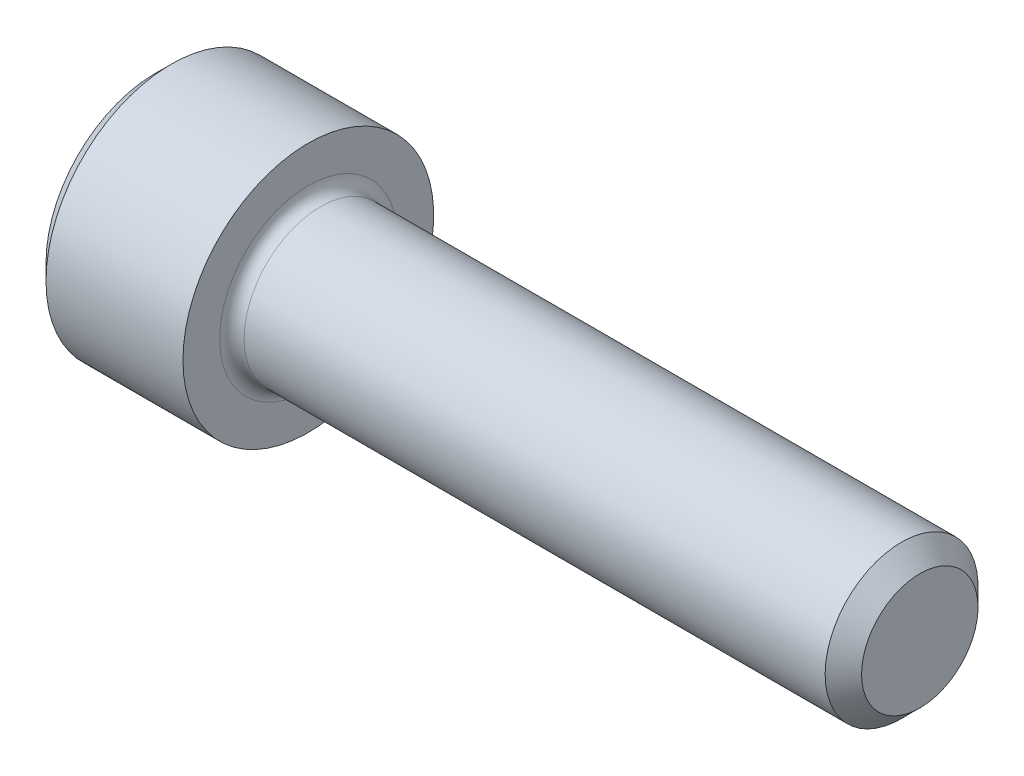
ISO-10303-21;
HEADER;
FILE_DESCRIPTION(('STEP AP214'),'2;1');
FILE_NAME('part.step','',(''),(''),'','','');
FILE_SCHEMA(('AUTOMOTIVE_DESIGN { 1 0 10303 214 1 1 1 1 }'));
ENDSEC;
DATA;
#1=APPLICATION_CONTEXT('core data for automotive mechanical design processes');
#2=APPLICATION_PROTOCOL_DEFINITION('international standard','automotive_design',2000,#1);
#3=PRODUCT_CONTEXT('',#1,'mechanical');
#4=PRODUCT('Part','Part','',(#3));
#5=PRODUCT_RELATED_PRODUCT_CATEGORY('part','',(#4));
#6=PRODUCT_DEFINITION_FORMATION('','',#4);
#7=PRODUCT_DEFINITION_CONTEXT('part definition',#1,'design');
#8=PRODUCT_DEFINITION('design','',#6,#7);
#9=PRODUCT_DEFINITION_SHAPE('','',#8);
#10=(LENGTH_UNIT() NAMED_UNIT(*) SI_UNIT(.MILLI.,.METRE.));
#11=(NAMED_UNIT(*) PLANE_ANGLE_UNIT() SI_UNIT($,.RADIAN.));
#12=(NAMED_UNIT(*) SI_UNIT($,.STERADIAN.) SOLID_ANGLE_UNIT());
#13=UNCERTAINTY_MEASURE_WITH_UNIT(LENGTH_MEASURE(1.E-05),#10,'distance_accuracy_value','');
#14=(GEOMETRIC_REPRESENTATION_CONTEXT(3) GLOBAL_UNCERTAINTY_ASSIGNED_CONTEXT((#13)) GLOBAL_UNIT_ASSIGNED_CONTEXT((#10,
#11,#12)) REPRESENTATION_CONTEXT('',''));
#15=CARTESIAN_POINT('',(0.,0.,0.));
#16=DIRECTION('',(0.,0.,1.));
#17=DIRECTION('',(1.,0.,0.));
#18=AXIS2_PLACEMENT_3D('',#15,#16,#17);
#19=CARTESIAN_POINT('',(0.,0.,0.));
#20=DIRECTION('',(-1.,0.,0.));
#21=DIRECTION('',(0.,0.,1.));
#22=AXIS2_PLACEMENT_3D('',#19,#20,#21);
#23=PLANE('',#22);
#24=DIRECTION('',(0.,-0.499999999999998,0.866025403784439));
#25=VECTOR('',#24,1.);
#26=CARTESIAN_POINT('',(0.,1.37848150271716,0.));
#27=LINE('',#26,#25);
#28=CARTESIAN_POINT('',(0.,1.37848150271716,0.));
#29=VERTEX_POINT('',#28);
#30=CARTESIAN_POINT('',(0.,0.689240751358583,1.1938));
#31=VERTEX_POINT('',#30);
#32=EDGE_CURVE('E265',#29,#31,#27,.T.);
#33=ORIENTED_EDGE('',*,*,#32,.T.);
#34=DIRECTION('',(0.,1.,0.));
#35=VECTOR('',#34,1.);
#36=CARTESIAN_POINT('',(0.,-0.689240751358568,1.1938));
#37=LINE('',#36,#35);
#38=CARTESIAN_POINT('',(0.,-0.689240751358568,1.1938));
#39=VERTEX_POINT('',#38);
#40=EDGE_CURVE('E125',#39,#31,#37,.T.);
#41=ORIENTED_EDGE('',*,*,#40,.F.);
#42=DIRECTION('',(0.,-0.500000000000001,-0.866025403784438));
#43=VECTOR('',#42,1.);
#44=CARTESIAN_POINT('',(0.,-0.689240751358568,1.1938));
#45=LINE('',#44,#43);
#46=CARTESIAN_POINT('',(0.,-1.37848150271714,0.));
#47=VERTEX_POINT('',#46);
#48=EDGE_CURVE('E268',#39,#47,#45,.T.);
#49=ORIENTED_EDGE('',*,*,#48,.T.);
#50=DIRECTION('',(0.,0.499999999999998,-0.86602540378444));
#51=VECTOR('',#50,1.);
#52=CARTESIAN_POINT('',(0.,-1.37848150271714,0.));
#53=LINE('',#52,#51);
#54=CARTESIAN_POINT('',(0.,-0.689240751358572,-1.1938));
#55=VERTEX_POINT('',#54);
#56=EDGE_CURVE('E271',#47,#55,#53,.T.);
#57=ORIENTED_EDGE('',*,*,#56,.T.);
#58=DIRECTION('',(0.,-1.,0.));
#59=VECTOR('',#58,1.);
#60=CARTESIAN_POINT('',(0.,0.689240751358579,-1.1938));
#61=LINE('',#60,#59);
#62=CARTESIAN_POINT('',(0.,0.689240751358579,-1.1938));
#63=VERTEX_POINT('',#62);
#64=EDGE_CURVE('E274',#63,#55,#61,.T.);
#65=ORIENTED_EDGE('',*,*,#64,.F.);
#66=DIRECTION('',(0.,-0.500000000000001,-0.866025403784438));
#67=VECTOR('',#66,1.);
#68=CARTESIAN_POINT('',(0.,1.37848150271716,0.));
#69=LINE('',#68,#67);
#70=EDGE_CURVE('E120',#29,#63,#69,.T.);
#71=ORIENTED_EDGE('',*,*,#70,.F.);
#72=EDGE_LOOP('',(#33,#41,#49,#57,#65,#71));
#73=FACE_BOUND('',#72,.T.);
#74=CARTESIAN_POINT('',(0.,0.,0.));
#75=DIRECTION('',(-1.,0.,0.));
#76=DIRECTION('',(0.,0.,1.));
#77=AXIS2_PLACEMENT_3D('',#74,#75,#76);
#78=CIRCLE('',#77,2.2733);
#79=CARTESIAN_POINT('',(0.,0.,2.2733));
#80=VERTEX_POINT('',#79);
#81=EDGE_CURVE('E149',#80,#80,#78,.T.);
#82=ORIENTED_EDGE('',*,*,#81,.T.);
#83=EDGE_LOOP('',(#82));
#84=FACE_BOUND('',#83,.T.);
#85=ADVANCED_FACE('F33',(#73,#84),#23,.T.);
#86=CARTESIAN_POINT('',(0.,0.,0.));
#87=DIRECTION('',(1.,0.,0.));
#88=DIRECTION('',(0.,0.,-1.));
#89=AXIS2_PLACEMENT_3D('',#86,#87,#88);
#90=CONICAL_SURFACE('',#89,2.2733,0.785398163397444);
#91=CARTESIAN_POINT('',(0.330200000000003,0.,0.));
#92=DIRECTION('',(-1.,0.,0.));
#93=DIRECTION('',(0.,0.,1.));
#94=AXIS2_PLACEMENT_3D('',#91,#92,#93);
#95=CIRCLE('',#94,2.6035);
#96=CARTESIAN_POINT('',(0.330200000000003,0.,2.6035));
#97=VERTEX_POINT('',#96);
#98=EDGE_CURVE('E146',#97,#97,#95,.T.);
#99=ORIENTED_EDGE('',*,*,#98,.T.);
#100=EDGE_LOOP('',(#99));
#101=FACE_BOUND('',#100,.T.);
#102=ORIENTED_EDGE('',*,*,#81,.F.);
#103=EDGE_LOOP('',(#102));
#104=FACE_BOUND('',#103,.T.);
#105=ADVANCED_FACE('F170',(#101,#104),#90,.T.);
#106=CARTESIAN_POINT('',(-31.75,0.,0.));
#107=DIRECTION('',(-1.,0.,0.));
#108=DIRECTION('',(0.,0.,1.));
#109=AXIS2_PLACEMENT_3D('',#106,#107,#108);
#110=CYLINDRICAL_SURFACE('',#109,2.6035);
#111=CARTESIAN_POINT('',(3.175,0.,0.));
#112=DIRECTION('',(-1.,0.,0.));
#113=DIRECTION('',(0.,0.,1.));
#114=AXIS2_PLACEMENT_3D('',#111,#112,#113);
#115=CIRCLE('',#114,2.6035);
#116=CARTESIAN_POINT('',(3.175,0.,2.6035));
#117=VERTEX_POINT('',#116);
#118=EDGE_CURVE('E143',#117,#117,#115,.T.);
#119=ORIENTED_EDGE('',*,*,#118,.T.);
#120=EDGE_LOOP('',(#119));
#121=FACE_BOUND('',#120,.T.);
#122=ORIENTED_EDGE('',*,*,#98,.F.);
#123=EDGE_LOOP('',(#122));
#124=FACE_BOUND('',#123,.T.);
#125=ADVANCED_FACE('F175',(#121,#124),#110,.T.);
#126=CARTESIAN_POINT('',(3.175,2.6035,0.));
#127=DIRECTION('',(1.,0.,0.));
#128=DIRECTION('',(0.,0.,-1.));
#129=AXIS2_PLACEMENT_3D('',#126,#127,#128);
#130=PLANE('',#129);
#131=CARTESIAN_POINT('',(3.175,0.,0.));
#132=DIRECTION('',(1.,0.,0.));
#133=DIRECTION('',(0.,0.,-1.));
#134=AXIS2_PLACEMENT_3D('',#131,#132,#133);
#135=CIRCLE('',#134,1.8415);
#136=CARTESIAN_POINT('',(3.175,0.,-1.8415));
#137=VERTEX_POINT('',#136);
#138=EDGE_CURVE('E41',#137,#137,#135,.F.);
#139=ORIENTED_EDGE('',*,*,#138,.T.);
#140=EDGE_LOOP('',(#139));
#141=FACE_BOUND('',#140,.T.);
#142=ORIENTED_EDGE('',*,*,#118,.F.);
#143=EDGE_LOOP('',(#142));
#144=FACE_BOUND('',#143,.T.);
#145=ADVANCED_FACE('F154',(#141,#144),#130,.T.);
#146=CARTESIAN_POINT('',(-31.75,0.,0.));
#147=DIRECTION('',(-1.,0.,0.));
#148=DIRECTION('',(0.,0.,1.));
#149=AXIS2_PLACEMENT_3D('',#146,#147,#148);
#150=CYLINDRICAL_SURFACE('',#149,1.5875);
#151=CARTESIAN_POINT('',(3.429,0.,0.));
#152=DIRECTION('',(1.,0.,0.));
#153=DIRECTION('',(0.,0.,-1.));
#154=AXIS2_PLACEMENT_3D('',#151,#152,#153);
#155=CIRCLE('',#154,1.5875);
#156=CARTESIAN_POINT('',(3.429,0.,-1.5875));
#157=VERTEX_POINT('',#156);
#158=EDGE_CURVE('E11',#157,#157,#155,.T.);
#159=ORIENTED_EDGE('',*,*,#158,.T.);
#160=EDGE_LOOP('',(#159));
#161=FACE_BOUND('',#160,.T.);
#162=CARTESIAN_POINT('',(15.49654,0.,0.));
#163=DIRECTION('',(-1.,0.,0.));
#164=DIRECTION('',(0.,0.,1.));
#165=AXIS2_PLACEMENT_3D('',#162,#163,#164);
#166=CIRCLE('',#165,1.5875);
#167=CARTESIAN_POINT('',(15.49654,0.,1.5875));
#168=VERTEX_POINT('',#167);
#169=EDGE_CURVE('E140',#168,#168,#166,.T.);
#170=ORIENTED_EDGE('',*,*,#169,.T.);
#171=EDGE_LOOP('',(#170));
#172=FACE_BOUND('',#171,.T.);
#173=ADVANCED_FACE('F185',(#161,#172),#150,.T.);
#174=CARTESIAN_POINT('',(15.875,0.,0.));
#175=DIRECTION('',(-1.,0.,0.));
#176=DIRECTION('',(0.,0.,1.));
#177=AXIS2_PLACEMENT_3D('',#174,#175,#176);
#178=CONICAL_SURFACE('',#177,1.20904,0.785398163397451);
#179=ORIENTED_EDGE('',*,*,#169,.F.);
#180=EDGE_LOOP('',(#179));
#181=FACE_BOUND('',#180,.T.);
#182=CARTESIAN_POINT('',(15.875,0.,0.));
#183=DIRECTION('',(-1.,0.,0.));
#184=DIRECTION('',(0.,0.,1.));
#185=AXIS2_PLACEMENT_3D('',#182,#183,#184);
#186=CIRCLE('',#185,1.20904);
#187=CARTESIAN_POINT('',(15.875,0.,1.20904));
#188=VERTEX_POINT('',#187);
#189=EDGE_CURVE('E136',#188,#188,#186,.T.);
#190=ORIENTED_EDGE('',*,*,#189,.T.);
#191=EDGE_LOOP('',(#190));
#192=FACE_BOUND('',#191,.T.);
#193=ADVANCED_FACE('F165',(#181,#192),#178,.T.);
#194=CARTESIAN_POINT('',(15.875,1.20904,0.));
#195=DIRECTION('',(1.,0.,0.));
#196=DIRECTION('',(0.,0.,-1.));
#197=AXIS2_PLACEMENT_3D('',#194,#195,#196);
#198=PLANE('',#197);
#199=ORIENTED_EDGE('',*,*,#189,.F.);
#200=EDGE_LOOP('',(#199));
#201=FACE_BOUND('',#200,.T.);
#202=ADVANCED_FACE('F158',(#201),#198,.T.);
#203=CARTESIAN_POINT('',(3.429,0.,0.));
#204=DIRECTION('',(1.,0.,0.));
#205=DIRECTION('',(0.,0.,-1.));
#206=AXIS2_PLACEMENT_3D('',#203,#204,#205);
#207=TOROIDAL_SURFACE('',#206,1.8415,0.254);
#208=ORIENTED_EDGE('',*,*,#158,.F.);
#209=EDGE_LOOP('',(#208));
#210=FACE_BOUND('',#209,.T.);
#211=ORIENTED_EDGE('',*,*,#138,.F.);
#212=EDGE_LOOP('',(#211));
#213=FACE_BOUND('',#212,.T.);
#214=ADVANCED_FACE('F35',(#210,#213),#207,.F.);
#215=CARTESIAN_POINT('',(1.4478,1.37848150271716,0.));
#216=DIRECTION('',(0.,-0.866025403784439,-0.499999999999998));
#217=DIRECTION('',(0.,0.499999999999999,-0.86602540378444));
#218=AXIS2_PLACEMENT_3D('',#215,#216,#217);
#219=PLANE('',#218);
#220=ORIENTED_EDGE('',*,*,#32,.F.);
#221=DIRECTION('',(-1.,0.,0.));
#222=VECTOR('',#221,1.);
#223=CARTESIAN_POINT('',(1.4478,1.37848150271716,0.));
#224=LINE('',#223,#222);
#225=CARTESIAN_POINT('',(1.4478,1.37848150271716,0.));
#226=VERTEX_POINT('',#225);
#227=EDGE_CURVE('E264',#226,#29,#224,.T.);
#228=ORIENTED_EDGE('',*,*,#227,.F.);
#229=DIRECTION('',(0.,-0.499999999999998,0.866025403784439));
#230=VECTOR('',#229,1.);
#231=CARTESIAN_POINT('',(1.4478,1.37848150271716,0.));
#232=LINE('',#231,#230);
#233=CARTESIAN_POINT('',(1.4478,1.03386112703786,0.596899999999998));
#234=VERTEX_POINT('',#233);
#235=EDGE_CURVE('E48',#226,#234,#232,.T.);
#236=ORIENTED_EDGE('',*,*,#235,.T.);
#237=CARTESIAN_POINT('',(1.4478,0.689240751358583,1.1938));
#238=VERTEX_POINT('',#237);
#239=EDGE_CURVE('E106',#234,#238,#232,.T.);
#240=ORIENTED_EDGE('',*,*,#239,.T.);
#241=DIRECTION('',(-1.,0.,0.));
#242=VECTOR('',#241,1.);
#243=CARTESIAN_POINT('',(1.4478,0.689240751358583,1.1938));
#244=LINE('',#243,#242);
#245=EDGE_CURVE('E118',#238,#31,#244,.T.);
#246=ORIENTED_EDGE('',*,*,#245,.T.);
#247=EDGE_LOOP('',(#220,#228,#236,#240,#246));
#248=FACE_BOUND('',#247,.T.);
#249=ADVANCED_FACE('F117',(#248),#219,.T.);
#250=CARTESIAN_POINT('',(1.4478,-0.689240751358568,1.1938));
#251=DIRECTION('',(0.,0.,1.));
#252=DIRECTION('',(0.,-1.,0.));
#253=AXIS2_PLACEMENT_3D('',#250,#251,#252);
#254=PLANE('',#253);
#255=ORIENTED_EDGE('',*,*,#40,.T.);
#256=ORIENTED_EDGE('',*,*,#245,.F.);
#257=DIRECTION('',(0.,1.,0.));
#258=VECTOR('',#257,1.);
#259=CARTESIAN_POINT('',(1.4478,-0.689240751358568,1.1938));
#260=LINE('',#259,#258);
#261=CARTESIAN_POINT('',(1.4478,0.,1.1938));
#262=VERTEX_POINT('',#261);
#263=EDGE_CURVE('E104',#262,#238,#260,.T.);
#264=ORIENTED_EDGE('',*,*,#263,.F.);
#265=CARTESIAN_POINT('',(1.4478,-0.689240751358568,1.1938));
#266=VERTEX_POINT('',#265);
#267=EDGE_CURVE('E114',#266,#262,#260,.T.);
#268=ORIENTED_EDGE('',*,*,#267,.F.);
#269=DIRECTION('',(-1.,0.,0.));
#270=VECTOR('',#269,1.);
#271=CARTESIAN_POINT('',(1.4478,-0.689240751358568,1.1938));
#272=LINE('',#271,#270);
#273=EDGE_CURVE('E127',#266,#39,#272,.T.);
#274=ORIENTED_EDGE('',*,*,#273,.T.);
#275=EDGE_LOOP('',(#255,#256,#264,#268,#274));
#276=FACE_BOUND('',#275,.T.);
#277=ADVANCED_FACE('F122',(#276),#254,.F.);
#278=CARTESIAN_POINT('',(1.4478,-0.689240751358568,1.1938));
#279=DIRECTION('',(0.,0.866025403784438,-0.500000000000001));
#280=DIRECTION('',(0.,0.500000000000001,0.866025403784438));
#281=AXIS2_PLACEMENT_3D('',#278,#279,#280);
#282=PLANE('',#281);
#283=ORIENTED_EDGE('',*,*,#48,.F.);
#284=ORIENTED_EDGE('',*,*,#273,.F.);
#285=DIRECTION('',(0.,-0.500000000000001,-0.866025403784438));
#286=VECTOR('',#285,1.);
#287=CARTESIAN_POINT('',(1.4478,-0.689240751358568,1.1938));
#288=LINE('',#287,#286);
#289=CARTESIAN_POINT('',(1.4478,-1.03386112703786,0.596899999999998));
#290=VERTEX_POINT('',#289);
#291=EDGE_CURVE('E245',#266,#290,#288,.T.);
#292=ORIENTED_EDGE('',*,*,#291,.T.);
#293=CARTESIAN_POINT('',(1.4478,-1.37848150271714,0.));
#294=VERTEX_POINT('',#293);
#295=EDGE_CURVE('E247',#290,#294,#288,.T.);
#296=ORIENTED_EDGE('',*,*,#295,.T.);
#297=DIRECTION('',(-1.,0.,0.));
#298=VECTOR('',#297,1.);
#299=CARTESIAN_POINT('',(1.4478,-1.37848150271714,0.));
#300=LINE('',#299,#298);
#301=EDGE_CURVE('E132',#294,#47,#300,.T.);
#302=ORIENTED_EDGE('',*,*,#301,.T.);
#303=EDGE_LOOP('',(#283,#284,#292,#296,#302));
#304=FACE_BOUND('',#303,.T.);
#305=ADVANCED_FACE('F197',(#304),#282,.T.);
#306=CARTESIAN_POINT('',(1.4478,-1.37848150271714,0.));
#307=DIRECTION('',(0.,0.866025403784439,0.499999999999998));
#308=DIRECTION('',(0.,-0.499999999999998,0.86602540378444));
#309=AXIS2_PLACEMENT_3D('',#306,#307,#308);
#310=PLANE('',#309);
#311=ORIENTED_EDGE('',*,*,#56,.F.);
#312=ORIENTED_EDGE('',*,*,#301,.F.);
#313=DIRECTION('',(0.,0.499999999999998,-0.86602540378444));
#314=VECTOR('',#313,1.);
#315=CARTESIAN_POINT('',(1.4478,-1.37848150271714,0.));
#316=LINE('',#315,#314);
#317=CARTESIAN_POINT('',(1.4478,-1.03386112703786,-0.596899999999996));
#318=VERTEX_POINT('',#317);
#319=EDGE_CURVE('E250',#294,#318,#316,.T.);
#320=ORIENTED_EDGE('',*,*,#319,.T.);
#321=CARTESIAN_POINT('',(1.4478,-0.689240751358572,-1.1938));
#322=VERTEX_POINT('',#321);
#323=EDGE_CURVE('E254',#318,#322,#316,.T.);
#324=ORIENTED_EDGE('',*,*,#323,.T.);
#325=DIRECTION('',(-1.,0.,0.));
#326=VECTOR('',#325,1.);
#327=CARTESIAN_POINT('',(1.4478,-0.689240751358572,-1.1938));
#328=LINE('',#327,#326);
#329=EDGE_CURVE('E283',#322,#55,#328,.T.);
#330=ORIENTED_EDGE('',*,*,#329,.T.);
#331=EDGE_LOOP('',(#311,#312,#320,#324,#330));
#332=FACE_BOUND('',#331,.T.);
#333=ADVANCED_FACE('F200',(#332),#310,.T.);
#334=CARTESIAN_POINT('',(1.4478,0.689240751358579,-1.1938));
#335=DIRECTION('',(0.,0.,-1.));
#336=DIRECTION('',(0.,1.,0.));
#337=AXIS2_PLACEMENT_3D('',#334,#335,#336);
#338=PLANE('',#337);
#339=ORIENTED_EDGE('',*,*,#64,.T.);
#340=ORIENTED_EDGE('',*,*,#329,.F.);
#341=DIRECTION('',(0.,-1.,0.));
#342=VECTOR('',#341,1.);
#343=CARTESIAN_POINT('',(1.4478,0.689240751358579,-1.1938));
#344=LINE('',#343,#342);
#345=CARTESIAN_POINT('',(1.4478,0.,-1.1938));
#346=VERTEX_POINT('',#345);
#347=EDGE_CURVE('E258',#346,#322,#344,.T.);
#348=ORIENTED_EDGE('',*,*,#347,.F.);
#349=CARTESIAN_POINT('',(1.4478,0.689240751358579,-1.1938));
#350=VERTEX_POINT('',#349);
#351=EDGE_CURVE('E259',#350,#346,#344,.T.);
#352=ORIENTED_EDGE('',*,*,#351,.F.);
#353=DIRECTION('',(-1.,0.,0.));
#354=VECTOR('',#353,1.);
#355=CARTESIAN_POINT('',(1.4478,0.689240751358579,-1.1938));
#356=LINE('',#355,#354);
#357=EDGE_CURVE('E280',#350,#63,#356,.T.);
#358=ORIENTED_EDGE('',*,*,#357,.T.);
#359=EDGE_LOOP('',(#339,#340,#348,#352,#358));
#360=FACE_BOUND('',#359,.T.);
#361=ADVANCED_FACE('F204',(#360),#338,.F.);
#362=CARTESIAN_POINT('',(1.4478,1.37848150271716,0.));
#363=DIRECTION('',(0.,0.866025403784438,-0.500000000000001));
#364=DIRECTION('',(0.,0.500000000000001,0.866025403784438));
#365=AXIS2_PLACEMENT_3D('',#362,#363,#364);
#366=PLANE('',#365);
#367=ORIENTED_EDGE('',*,*,#70,.T.);
#368=ORIENTED_EDGE('',*,*,#357,.F.);
#369=DIRECTION('',(0.,-0.500000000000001,-0.866025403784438));
#370=VECTOR('',#369,1.);
#371=CARTESIAN_POINT('',(1.4478,1.37848150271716,0.));
#372=LINE('',#371,#370);
#373=CARTESIAN_POINT('',(1.4478,1.03386112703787,-0.596900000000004));
#374=VERTEX_POINT('',#373);
#375=EDGE_CURVE('E262',#374,#350,#372,.T.);
#376=ORIENTED_EDGE('',*,*,#375,.F.);
#377=EDGE_CURVE('E236',#226,#374,#372,.T.);
#378=ORIENTED_EDGE('',*,*,#377,.F.);
#379=ORIENTED_EDGE('',*,*,#227,.T.);
#380=EDGE_LOOP('',(#367,#368,#376,#378,#379));
#381=FACE_BOUND('',#380,.T.);
#382=ADVANCED_FACE('F208',(#381),#366,.F.);
#383=CARTESIAN_POINT('',(1.4478,0.689240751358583,1.1938));
#384=DIRECTION('',(-1.,0.,0.));
#385=DIRECTION('',(0.,0.,1.));
#386=AXIS2_PLACEMENT_3D('',#383,#384,#385);
#387=PLANE('',#386);
#388=CARTESIAN_POINT('',(1.4478,0.,0.));
#389=DIRECTION('',(-1.,0.,0.));
#390=DIRECTION('',(0.,0.,1.));
#391=AXIS2_PLACEMENT_3D('',#388,#389,#390);
#392=CIRCLE('',#391,1.1938);
#393=EDGE_CURVE('E126',#290,#262,#392,.T.);
#394=ORIENTED_EDGE('',*,*,#393,.F.);
#395=ORIENTED_EDGE('',*,*,#291,.F.);
#396=ORIENTED_EDGE('',*,*,#267,.T.);
#397=EDGE_LOOP('',(#394,#395,#396));
#398=FACE_BOUND('',#397,.T.);
#399=ADVANCED_FACE('F212',(#398),#387,.T.);
#400=EDGE_CURVE('E130',#318,#290,#392,.T.);
#401=ORIENTED_EDGE('',*,*,#400,.F.);
#402=ORIENTED_EDGE('',*,*,#319,.F.);
#403=ORIENTED_EDGE('',*,*,#295,.F.);
#404=EDGE_LOOP('',(#401,#402,#403));
#405=FACE_BOUND('',#404,.T.);
#406=ADVANCED_FACE('F215',(#405),#387,.T.);
#407=EDGE_CURVE('E289',#346,#318,#392,.T.);
#408=ORIENTED_EDGE('',*,*,#407,.F.);
#409=ORIENTED_EDGE('',*,*,#347,.T.);
#410=ORIENTED_EDGE('',*,*,#323,.F.);
#411=EDGE_LOOP('',(#408,#409,#410));
#412=FACE_BOUND('',#411,.T.);
#413=ADVANCED_FACE('F220',(#412),#387,.T.);
#414=EDGE_CURVE('E239',#374,#346,#392,.T.);
#415=ORIENTED_EDGE('',*,*,#414,.F.);
#416=ORIENTED_EDGE('',*,*,#375,.T.);
#417=ORIENTED_EDGE('',*,*,#351,.T.);
#418=EDGE_LOOP('',(#415,#416,#417));
#419=FACE_BOUND('',#418,.T.);
#420=ADVANCED_FACE('F227',(#419),#387,.T.);
#421=EDGE_CURVE('E137',#234,#374,#392,.T.);
#422=ORIENTED_EDGE('',*,*,#421,.F.);
#423=ORIENTED_EDGE('',*,*,#235,.F.);
#424=ORIENTED_EDGE('',*,*,#377,.T.);
#425=EDGE_LOOP('',(#422,#423,#424));
#426=FACE_BOUND('',#425,.T.);
#427=ADVANCED_FACE('F223',(#426),#387,.T.);
#428=EDGE_CURVE('E109',#262,#234,#392,.T.);
#429=ORIENTED_EDGE('',*,*,#428,.F.);
#430=ORIENTED_EDGE('',*,*,#263,.T.);
#431=ORIENTED_EDGE('',*,*,#239,.F.);
#432=EDGE_LOOP('',(#429,#430,#431));
#433=FACE_BOUND('',#432,.T.);
#434=ADVANCED_FACE('F105',(#433),#387,.T.);
#435=CARTESIAN_POINT('',(1.4478,0.,0.));
#436=DIRECTION('',(-1.,0.,0.));
#437=DIRECTION('',(0.,0.,1.));
#438=AXIS2_PLACEMENT_3D('',#435,#436,#437);
#439=CONICAL_SURFACE('',#438,1.1938,1.04719755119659);
#440=CARTESIAN_POINT('',(2.13704075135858,0.,0.));
#441=VERTEX_POINT('',#440);
#442=VERTEX_LOOP('',#441);
#443=FACE_BOUND('',#442,.T.);
#444=ORIENTED_EDGE('',*,*,#428,.T.);
#445=ORIENTED_EDGE('',*,*,#421,.T.);
#446=ORIENTED_EDGE('',*,*,#414,.T.);
#447=ORIENTED_EDGE('',*,*,#407,.T.);
#448=ORIENTED_EDGE('',*,*,#400,.T.);
#449=ORIENTED_EDGE('',*,*,#393,.T.);
#450=EDGE_LOOP('',(#444,#445,#446,#447,#448,#449));
#451=FACE_BOUND('',#450,.T.);
#452=ADVANCED_FACE('F192',(#443,#451),#439,.F.);
#453=CLOSED_SHELL('',(#85,#105,#125,#145,#173,#193,#202,#214,#249,#277,#305,#333,#361,#382,#399,
#406,#413,#420,#427,#434,#452));
#454=MANIFOLD_SOLID_BREP('B2',#453);
#455=ADVANCED_BREP_SHAPE_REPRESENTATION('',(#18,#454),#14);
#456=SHAPE_DEFINITION_REPRESENTATION(#9,#455);
ENDSEC;
END-ISO-10303-21;
